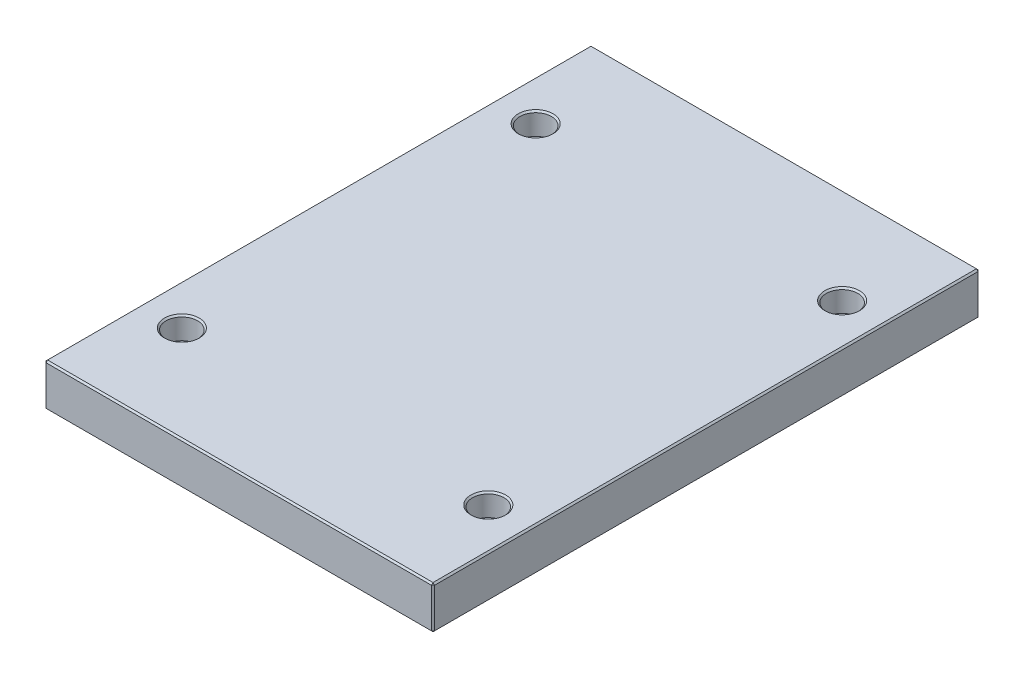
ISO-10303-21;
HEADER;
FILE_DESCRIPTION(('STEP AP214'),'2;1');
FILE_NAME('part.step','',(''),(''),'','','');
FILE_SCHEMA(('AUTOMOTIVE_DESIGN { 1 0 10303 214 1 1 1 1 }'));
ENDSEC;
DATA;
#1=APPLICATION_CONTEXT('core data for automotive mechanical design processes');
#2=APPLICATION_PROTOCOL_DEFINITION('international standard','automotive_design',2000,#1);
#3=PRODUCT_CONTEXT('',#1,'mechanical');
#4=PRODUCT('Part','Part','',(#3));
#5=PRODUCT_RELATED_PRODUCT_CATEGORY('part','',(#4));
#6=PRODUCT_DEFINITION_FORMATION('','',#4);
#7=PRODUCT_DEFINITION_CONTEXT('part definition',#1,'design');
#8=PRODUCT_DEFINITION('design','',#6,#7);
#9=PRODUCT_DEFINITION_SHAPE('','',#8);
#10=(LENGTH_UNIT() NAMED_UNIT(*) SI_UNIT(.MILLI.,.METRE.));
#11=(NAMED_UNIT(*) PLANE_ANGLE_UNIT() SI_UNIT($,.RADIAN.));
#12=(NAMED_UNIT(*) SI_UNIT($,.STERADIAN.) SOLID_ANGLE_UNIT());
#13=UNCERTAINTY_MEASURE_WITH_UNIT(LENGTH_MEASURE(1.E-05),#10,'distance_accuracy_value','');
#14=(GEOMETRIC_REPRESENTATION_CONTEXT(3) GLOBAL_UNCERTAINTY_ASSIGNED_CONTEXT((#13)) GLOBAL_UNIT_ASSIGNED_CONTEXT((#10,
#11,#12)) REPRESENTATION_CONTEXT('',''));
#15=CARTESIAN_POINT('',(0.,0.,0.));
#16=DIRECTION('',(0.,0.,1.));
#17=DIRECTION('',(1.,0.,0.));
#18=AXIS2_PLACEMENT_3D('',#15,#16,#17);
#19=CARTESIAN_POINT('',(-123.,27.,173.));
#20=DIRECTION('',(1.,0.,0.));
#21=DIRECTION('',(0.,0.,-1.));
#22=AXIS2_PLACEMENT_3D('',#19,#20,#21);
#23=PLANE('',#22);
#24=DIRECTION('',(0.,-1.,0.));
#25=VECTOR('',#24,1.);
#26=CARTESIAN_POINT('',(-123.,27.,-172.));
#27=LINE('',#26,#25);
#28=CARTESIAN_POINT('',(-123.,26.,-172.));
#29=VERTEX_POINT('',#28);
#30=CARTESIAN_POINT('',(-123.,1.,-172.));
#31=VERTEX_POINT('',#30);
#32=EDGE_CURVE('E115',#29,#31,#27,.T.);
#33=ORIENTED_EDGE('',*,*,#32,.T.);
#34=DIRECTION('',(0.,0.,1.));
#35=VECTOR('',#34,1.);
#36=CARTESIAN_POINT('',(-123.,1.,173.));
#37=LINE('',#36,#35);
#38=CARTESIAN_POINT('',(-123.,1.,172.));
#39=VERTEX_POINT('',#38);
#40=EDGE_CURVE('E111',#31,#39,#37,.T.);
#41=ORIENTED_EDGE('',*,*,#40,.T.);
#42=DIRECTION('',(0.,1.,0.));
#43=VECTOR('',#42,1.);
#44=CARTESIAN_POINT('',(-123.,27.,172.));
#45=LINE('',#44,#43);
#46=CARTESIAN_POINT('',(-123.,26.,172.));
#47=VERTEX_POINT('',#46);
#48=EDGE_CURVE('E104',#39,#47,#45,.T.);
#49=ORIENTED_EDGE('',*,*,#48,.T.);
#50=DIRECTION('',(0.,0.,-1.));
#51=VECTOR('',#50,1.);
#52=CARTESIAN_POINT('',(-123.,26.,-173.));
#53=LINE('',#52,#51);
#54=EDGE_CURVE('E108',#47,#29,#53,.T.);
#55=ORIENTED_EDGE('',*,*,#54,.T.);
#56=EDGE_LOOP('',(#33,#41,#49,#55));
#57=FACE_BOUND('',#56,.T.);
#58=ADVANCED_FACE('F16',(#57),#23,.F.);
#59=CARTESIAN_POINT('',(123.,27.,173.));
#60=DIRECTION('',(0.,0.,-1.));
#61=DIRECTION('',(-1.,0.,0.));
#62=AXIS2_PLACEMENT_3D('',#59,#60,#61);
#63=PLANE('',#62);
#64=DIRECTION('',(-1.,0.,0.));
#65=VECTOR('',#64,1.);
#66=CARTESIAN_POINT('',(-123.,26.,173.));
#67=LINE('',#66,#65);
#68=CARTESIAN_POINT('',(122.,26.,173.));
#69=VERTEX_POINT('',#68);
#70=CARTESIAN_POINT('',(-122.,26.,173.));
#71=VERTEX_POINT('',#70);
#72=EDGE_CURVE('E170',#69,#71,#67,.T.);
#73=ORIENTED_EDGE('',*,*,#72,.T.);
#74=DIRECTION('',(0.,-1.,0.));
#75=VECTOR('',#74,1.);
#76=CARTESIAN_POINT('',(-122.,27.,173.));
#77=LINE('',#76,#75);
#78=CARTESIAN_POINT('',(-122.,0.999999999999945,173.));
#79=VERTEX_POINT('',#78);
#80=EDGE_CURVE('E123',#71,#79,#77,.T.);
#81=ORIENTED_EDGE('',*,*,#80,.T.);
#82=DIRECTION('',(1.,0.,0.));
#83=VECTOR('',#82,1.);
#84=CARTESIAN_POINT('',(123.,0.999999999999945,173.));
#85=LINE('',#84,#83);
#86=CARTESIAN_POINT('',(122.,0.999999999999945,173.));
#87=VERTEX_POINT('',#86);
#88=EDGE_CURVE('E174',#79,#87,#85,.T.);
#89=ORIENTED_EDGE('',*,*,#88,.T.);
#90=DIRECTION('',(0.,1.,0.));
#91=VECTOR('',#90,1.);
#92=CARTESIAN_POINT('',(122.,27.,173.));
#93=LINE('',#92,#91);
#94=EDGE_CURVE('E172',#87,#69,#93,.T.);
#95=ORIENTED_EDGE('',*,*,#94,.T.);
#96=EDGE_LOOP('',(#73,#81,#89,#95));
#97=FACE_BOUND('',#96,.T.);
#98=ADVANCED_FACE('F317',(#97),#63,.F.);
#99=CARTESIAN_POINT('',(123.,27.,173.));
#100=DIRECTION('',(-1.,0.,0.));
#101=DIRECTION('',(0.,0.,1.));
#102=AXIS2_PLACEMENT_3D('',#99,#100,#101);
#103=PLANE('',#102);
#104=DIRECTION('',(0.,0.,-1.));
#105=VECTOR('',#104,1.);
#106=CARTESIAN_POINT('',(123.,0.999999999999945,173.));
#107=LINE('',#106,#105);
#108=CARTESIAN_POINT('',(123.,0.999999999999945,172.));
#109=VERTEX_POINT('',#108);
#110=CARTESIAN_POINT('',(123.,0.999999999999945,-172.));
#111=VERTEX_POINT('',#110);
#112=EDGE_CURVE('E165',#109,#111,#107,.T.);
#113=ORIENTED_EDGE('',*,*,#112,.T.);
#114=DIRECTION('',(0.,1.,0.));
#115=VECTOR('',#114,1.);
#116=CARTESIAN_POINT('',(123.,27.,-172.));
#117=LINE('',#116,#115);
#118=CARTESIAN_POINT('',(123.,26.,-172.));
#119=VERTEX_POINT('',#118);
#120=EDGE_CURVE('E167',#111,#119,#117,.T.);
#121=ORIENTED_EDGE('',*,*,#120,.T.);
#122=DIRECTION('',(0.,0.,1.));
#123=VECTOR('',#122,1.);
#124=CARTESIAN_POINT('',(123.,26.,173.));
#125=LINE('',#124,#123);
#126=CARTESIAN_POINT('',(123.,26.,172.));
#127=VERTEX_POINT('',#126);
#128=EDGE_CURVE('E161',#119,#127,#125,.T.);
#129=ORIENTED_EDGE('',*,*,#128,.T.);
#130=DIRECTION('',(0.,-1.,0.));
#131=VECTOR('',#130,1.);
#132=CARTESIAN_POINT('',(123.,27.,172.));
#133=LINE('',#132,#131);
#134=EDGE_CURVE('E163',#127,#109,#133,.T.);
#135=ORIENTED_EDGE('',*,*,#134,.T.);
#136=EDGE_LOOP('',(#113,#121,#129,#135));
#137=FACE_BOUND('',#136,.T.);
#138=ADVANCED_FACE('F323',(#137),#103,.F.);
#139=CARTESIAN_POINT('',(123.,27.,-173.));
#140=DIRECTION('',(0.,0.,1.));
#141=DIRECTION('',(1.,0.,0.));
#142=AXIS2_PLACEMENT_3D('',#139,#140,#141);
#143=PLANE('',#142);
#144=DIRECTION('',(0.,-1.,0.));
#145=VECTOR('',#144,1.);
#146=CARTESIAN_POINT('',(122.,27.,-173.));
#147=LINE('',#146,#145);
#148=CARTESIAN_POINT('',(122.,26.,-173.));
#149=VERTEX_POINT('',#148);
#150=CARTESIAN_POINT('',(122.,0.999999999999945,-173.));
#151=VERTEX_POINT('',#150);
#152=EDGE_CURVE('E154',#149,#151,#147,.T.);
#153=ORIENTED_EDGE('',*,*,#152,.T.);
#154=DIRECTION('',(-1.,0.,0.));
#155=VECTOR('',#154,1.);
#156=CARTESIAN_POINT('',(123.,0.999999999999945,-173.));
#157=LINE('',#156,#155);
#158=CARTESIAN_POINT('',(-122.,0.999999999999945,-173.));
#159=VERTEX_POINT('',#158);
#160=EDGE_CURVE('E159',#151,#159,#157,.T.);
#161=ORIENTED_EDGE('',*,*,#160,.T.);
#162=DIRECTION('',(0.,1.,0.));
#163=VECTOR('',#162,1.);
#164=CARTESIAN_POINT('',(-122.,27.,-173.));
#165=LINE('',#164,#163);
#166=CARTESIAN_POINT('',(-122.,26.,-173.));
#167=VERTEX_POINT('',#166);
#168=EDGE_CURVE('E156',#159,#167,#165,.T.);
#169=ORIENTED_EDGE('',*,*,#168,.T.);
#170=DIRECTION('',(1.,0.,0.));
#171=VECTOR('',#170,1.);
#172=CARTESIAN_POINT('',(123.,26.,-173.));
#173=LINE('',#172,#171);
#174=EDGE_CURVE('E152',#167,#149,#173,.T.);
#175=ORIENTED_EDGE('',*,*,#174,.T.);
#176=EDGE_LOOP('',(#153,#161,#169,#175));
#177=FACE_BOUND('',#176,.T.);
#178=ADVANCED_FACE('F465',(#177),#143,.F.);
#179=CARTESIAN_POINT('',(0.,27.,0.));
#180=DIRECTION('',(0.,1.,0.));
#181=DIRECTION('',(0.,0.,1.));
#182=AXIS2_PLACEMENT_3D('',#179,#180,#181);
#183=PLANE('',#182);
#184=CARTESIAN_POINT('',(-97.,27.,112.));
#185=DIRECTION('',(0.,1.,0.));
#186=DIRECTION('',(0.,0.,1.));
#187=AXIS2_PLACEMENT_3D('',#184,#185,#186);
#188=CIRCLE('',#187,11.);
#189=CARTESIAN_POINT('',(-97.,27.,123.));
#190=VERTEX_POINT('',#189);
#191=EDGE_CURVE('E290',#190,#190,#188,.F.);
#192=ORIENTED_EDGE('',*,*,#191,.T.);
#193=EDGE_LOOP('',(#192));
#194=FACE_BOUND('',#193,.T.);
#195=CARTESIAN_POINT('',(97.,27.,112.));
#196=DIRECTION('',(0.,1.,0.));
#197=DIRECTION('',(0.,0.,1.));
#198=AXIS2_PLACEMENT_3D('',#195,#196,#197);
#199=CIRCLE('',#198,11.);
#200=CARTESIAN_POINT('',(97.,27.,123.));
#201=VERTEX_POINT('',#200);
#202=EDGE_CURVE('E287',#201,#201,#199,.F.);
#203=ORIENTED_EDGE('',*,*,#202,.T.);
#204=EDGE_LOOP('',(#203));
#205=FACE_BOUND('',#204,.T.);
#206=CARTESIAN_POINT('',(97.,27.,-112.));
#207=DIRECTION('',(0.,1.,0.));
#208=DIRECTION('',(0.,0.,1.));
#209=AXIS2_PLACEMENT_3D('',#206,#207,#208);
#210=CIRCLE('',#209,11.);
#211=CARTESIAN_POINT('',(97.,27.,-101.));
#212=VERTEX_POINT('',#211);
#213=EDGE_CURVE('E284',#212,#212,#210,.F.);
#214=ORIENTED_EDGE('',*,*,#213,.T.);
#215=EDGE_LOOP('',(#214));
#216=FACE_BOUND('',#215,.T.);
#217=CARTESIAN_POINT('',(-97.,27.,-112.));
#218=DIRECTION('',(0.,1.,0.));
#219=DIRECTION('',(0.,0.,1.));
#220=AXIS2_PLACEMENT_3D('',#217,#218,#219);
#221=CIRCLE('',#220,11.);
#222=CARTESIAN_POINT('',(-97.,27.,-101.));
#223=VERTEX_POINT('',#222);
#224=EDGE_CURVE('E281',#223,#223,#221,.F.);
#225=ORIENTED_EDGE('',*,*,#224,.T.);
#226=EDGE_LOOP('',(#225));
#227=FACE_BOUND('',#226,.T.);
#228=DIRECTION('',(0.,0.,-1.));
#229=VECTOR('',#228,1.);
#230=CARTESIAN_POINT('',(122.,27.,-173.));
#231=LINE('',#230,#229);
#232=CARTESIAN_POINT('',(122.,27.,172.));
#233=VERTEX_POINT('',#232);
#234=CARTESIAN_POINT('',(122.,27.,-172.));
#235=VERTEX_POINT('',#234);
#236=EDGE_CURVE('E31',#233,#235,#231,.T.);
#237=ORIENTED_EDGE('',*,*,#236,.T.);
#238=DIRECTION('',(-1.,0.,0.));
#239=VECTOR('',#238,1.);
#240=CARTESIAN_POINT('',(-123.,27.,-172.));
#241=LINE('',#240,#239);
#242=CARTESIAN_POINT('',(-122.,27.,-172.));
#243=VERTEX_POINT('',#242);
#244=EDGE_CURVE('E190',#235,#243,#241,.T.);
#245=ORIENTED_EDGE('',*,*,#244,.T.);
#246=DIRECTION('',(0.,0.,1.));
#247=VECTOR('',#246,1.);
#248=CARTESIAN_POINT('',(-122.,27.,173.));
#249=LINE('',#248,#247);
#250=CARTESIAN_POINT('',(-122.,27.,172.));
#251=VERTEX_POINT('',#250);
#252=EDGE_CURVE('E186',#243,#251,#249,.T.);
#253=ORIENTED_EDGE('',*,*,#252,.T.);
#254=DIRECTION('',(1.,0.,0.));
#255=VECTOR('',#254,1.);
#256=CARTESIAN_POINT('',(123.,27.,172.));
#257=LINE('',#256,#255);
#258=EDGE_CURVE('E36',#251,#233,#257,.T.);
#259=ORIENTED_EDGE('',*,*,#258,.T.);
#260=EDGE_LOOP('',(#237,#245,#253,#259));
#261=FACE_BOUND('',#260,.T.);
#262=ADVANCED_FACE('F462',(#194,#205,#216,#227,#261),#183,.T.);
#263=CARTESIAN_POINT('',(0.,0.,0.));
#264=DIRECTION('',(0.,1.,0.));
#265=DIRECTION('',(0.,0.,1.));
#266=AXIS2_PLACEMENT_3D('',#263,#264,#265);
#267=PLANE('',#266);
#268=CARTESIAN_POINT('',(97.,0.,-112.));
#269=DIRECTION('',(0.,1.,0.));
#270=DIRECTION('',(0.,0.,1.));
#271=AXIS2_PLACEMENT_3D('',#268,#269,#270);
#272=CIRCLE('',#271,8.);
#273=CARTESIAN_POINT('',(97.,0.,-104.));
#274=VERTEX_POINT('',#273);
#275=EDGE_CURVE('E263',#274,#274,#272,.T.);
#276=ORIENTED_EDGE('',*,*,#275,.T.);
#277=EDGE_LOOP('',(#276));
#278=FACE_BOUND('',#277,.T.);
#279=CARTESIAN_POINT('',(97.,0.,112.));
#280=DIRECTION('',(0.,1.,0.));
#281=DIRECTION('',(0.,0.,1.));
#282=AXIS2_PLACEMENT_3D('',#279,#280,#281);
#283=CIRCLE('',#282,8.);
#284=CARTESIAN_POINT('',(97.,0.,120.));
#285=VERTEX_POINT('',#284);
#286=EDGE_CURVE('E260',#285,#285,#283,.T.);
#287=ORIENTED_EDGE('',*,*,#286,.T.);
#288=EDGE_LOOP('',(#287));
#289=FACE_BOUND('',#288,.T.);
#290=CARTESIAN_POINT('',(-97.,0.,112.));
#291=DIRECTION('',(0.,1.,0.));
#292=DIRECTION('',(0.,0.,1.));
#293=AXIS2_PLACEMENT_3D('',#290,#291,#292);
#294=CIRCLE('',#293,7.9999999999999);
#295=CARTESIAN_POINT('',(-97.,0.,120.));
#296=VERTEX_POINT('',#295);
#297=EDGE_CURVE('E257',#296,#296,#294,.T.);
#298=ORIENTED_EDGE('',*,*,#297,.T.);
#299=EDGE_LOOP('',(#298));
#300=FACE_BOUND('',#299,.T.);
#301=CARTESIAN_POINT('',(-97.,0.,-112.));
#302=DIRECTION('',(0.,1.,0.));
#303=DIRECTION('',(0.,0.,1.));
#304=AXIS2_PLACEMENT_3D('',#301,#302,#303);
#305=CIRCLE('',#304,8.);
#306=CARTESIAN_POINT('',(-97.,0.,-104.));
#307=VERTEX_POINT('',#306);
#308=EDGE_CURVE('E192',#307,#307,#305,.T.);
#309=ORIENTED_EDGE('',*,*,#308,.T.);
#310=EDGE_LOOP('',(#309));
#311=FACE_BOUND('',#310,.T.);
#312=DIRECTION('',(0.,0.,1.));
#313=VECTOR('',#312,1.);
#314=CARTESIAN_POINT('',(122.,0.,0.));
#315=LINE('',#314,#313);
#316=CARTESIAN_POINT('',(122.,0.,-172.));
#317=VERTEX_POINT('',#316);
#318=CARTESIAN_POINT('',(122.,0.,172.));
#319=VERTEX_POINT('',#318);
#320=EDGE_CURVE('E177',#317,#319,#315,.T.);
#321=ORIENTED_EDGE('',*,*,#320,.T.);
#322=DIRECTION('',(-1.,0.,0.));
#323=VECTOR('',#322,1.);
#324=CARTESIAN_POINT('',(0.,0.,172.));
#325=LINE('',#324,#323);
#326=CARTESIAN_POINT('',(-122.,0.,172.));
#327=VERTEX_POINT('',#326);
#328=EDGE_CURVE('E183',#319,#327,#325,.T.);
#329=ORIENTED_EDGE('',*,*,#328,.T.);
#330=DIRECTION('',(0.,0.,-1.));
#331=VECTOR('',#330,1.);
#332=CARTESIAN_POINT('',(-122.,0.,0.));
#333=LINE('',#332,#331);
#334=CARTESIAN_POINT('',(-122.,0.,-172.));
#335=VERTEX_POINT('',#334);
#336=EDGE_CURVE('E181',#327,#335,#333,.T.);
#337=ORIENTED_EDGE('',*,*,#336,.T.);
#338=DIRECTION('',(1.,0.,0.));
#339=VECTOR('',#338,1.);
#340=CARTESIAN_POINT('',(0.,0.,-172.));
#341=LINE('',#340,#339);
#342=EDGE_CURVE('E179',#335,#317,#341,.T.);
#343=ORIENTED_EDGE('',*,*,#342,.T.);
#344=EDGE_LOOP('',(#321,#329,#337,#343));
#345=FACE_BOUND('',#344,.T.);
#346=ADVANCED_FACE('F402',(#278,#289,#300,#311,#345),#267,.F.);
#347=CARTESIAN_POINT('',(123.,27.,172.));
#348=DIRECTION('',(-0.707106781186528,0.,-0.707106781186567));
#349=DIRECTION('',(0.,-1.,0.));
#350=AXIS2_PLACEMENT_3D('',#347,#348,#349);
#351=PLANE('',#350);
#352=DIRECTION('',(-0.707106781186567,0.,0.707106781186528));
#353=VECTOR('',#352,1.);
#354=CARTESIAN_POINT('',(122.,26.,173.));
#355=LINE('',#354,#353);
#356=EDGE_CURVE('E141',#69,#127,#355,.F.);
#357=ORIENTED_EDGE('',*,*,#356,.F.);
#358=ORIENTED_EDGE('',*,*,#94,.F.);
#359=DIRECTION('',(0.707106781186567,0.,-0.707106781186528));
#360=VECTOR('',#359,1.);
#361=CARTESIAN_POINT('',(122.,0.999999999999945,173.));
#362=LINE('',#361,#360);
#363=EDGE_CURVE('E144',#109,#87,#362,.F.);
#364=ORIENTED_EDGE('',*,*,#363,.F.);
#365=ORIENTED_EDGE('',*,*,#134,.F.);
#366=EDGE_LOOP('',(#357,#358,#364,#365));
#367=FACE_BOUND('',#366,.T.);
#368=ADVANCED_FACE('F398',(#367),#351,.F.);
#369=CARTESIAN_POINT('',(122.,26.,173.));
#370=DIRECTION('',(0.577350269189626,0.577350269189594,0.577350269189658));
#371=DIRECTION('',(0.707106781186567,0.,-0.707106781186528));
#372=AXIS2_PLACEMENT_3D('',#369,#370,#371);
#373=PLANE('',#372);
#374=DIRECTION('',(0.,-0.707106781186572,0.707106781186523));
#375=VECTOR('',#374,1.);
#376=CARTESIAN_POINT('',(122.,26.,173.));
#377=LINE('',#376,#375);
#378=EDGE_CURVE('E235',#69,#233,#377,.F.);
#379=ORIENTED_EDGE('',*,*,#378,.F.);
#380=ORIENTED_EDGE('',*,*,#356,.T.);
#381=DIRECTION('',(-0.707106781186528,0.707106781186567,0.));
#382=VECTOR('',#381,1.);
#383=CARTESIAN_POINT('',(122.5,26.5,172.));
#384=LINE('',#383,#382);
#385=EDGE_CURVE('E237',#233,#127,#384,.F.);
#386=ORIENTED_EDGE('',*,*,#385,.F.);
#387=EDGE_LOOP('',(#379,#380,#386));
#388=FACE_BOUND('',#387,.T.);
#389=ADVANCED_FACE('F394',(#388),#373,.T.);
#390=CARTESIAN_POINT('',(122.,0.999999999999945,173.));
#391=DIRECTION('',(0.577350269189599,-0.577350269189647,0.577350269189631));
#392=DIRECTION('',(0.,-0.707106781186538,-0.707106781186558));
#393=AXIS2_PLACEMENT_3D('',#390,#391,#392);
#394=PLANE('',#393);
#395=DIRECTION('',(-0.707106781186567,-0.707106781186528,0.));
#396=VECTOR('',#395,1.);
#397=CARTESIAN_POINT('',(122.5,0.499999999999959,172.));
#398=LINE('',#397,#396);
#399=EDGE_CURVE('E229',#109,#319,#398,.T.);
#400=ORIENTED_EDGE('',*,*,#399,.F.);
#401=ORIENTED_EDGE('',*,*,#363,.T.);
#402=DIRECTION('',(0.,0.707106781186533,0.707106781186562));
#403=VECTOR('',#402,1.);
#404=CARTESIAN_POINT('',(122.,0.999999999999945,173.));
#405=LINE('',#404,#403);
#406=EDGE_CURVE('E232',#319,#87,#405,.T.);
#407=ORIENTED_EDGE('',*,*,#406,.F.);
#408=EDGE_LOOP('',(#400,#401,#407));
#409=FACE_BOUND('',#408,.T.);
#410=ADVANCED_FACE('F390',(#409),#394,.T.);
#411=CARTESIAN_POINT('',(122.,27.,0.));
#412=DIRECTION('',(0.707106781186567,0.707106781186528,0.));
#413=DIRECTION('',(0.,0.,1.));
#414=AXIS2_PLACEMENT_3D('',#411,#412,#413);
#415=PLANE('',#414);
#416=ORIENTED_EDGE('',*,*,#385,.T.);
#417=ORIENTED_EDGE('',*,*,#128,.F.);
#418=DIRECTION('',(0.707106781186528,-0.707106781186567,0.));
#419=VECTOR('',#418,1.);
#420=CARTESIAN_POINT('',(123.,26.,-172.));
#421=LINE('',#420,#419);
#422=EDGE_CURVE('E224',#235,#119,#421,.T.);
#423=ORIENTED_EDGE('',*,*,#422,.F.);
#424=ORIENTED_EDGE('',*,*,#236,.F.);
#425=EDGE_LOOP('',(#416,#417,#423,#424));
#426=FACE_BOUND('',#425,.T.);
#427=ADVANCED_FACE('F386',(#426),#415,.T.);
#428=CARTESIAN_POINT('',(0.,27.,172.));
#429=DIRECTION('',(0.,0.707106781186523,0.707106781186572));
#430=DIRECTION('',(-1.,0.,0.));
#431=AXIS2_PLACEMENT_3D('',#428,#429,#430);
#432=PLANE('',#431);
#433=ORIENTED_EDGE('',*,*,#378,.T.);
#434=ORIENTED_EDGE('',*,*,#258,.F.);
#435=DIRECTION('',(0.,0.707106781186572,-0.707106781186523));
#436=VECTOR('',#435,1.);
#437=CARTESIAN_POINT('',(-122.,26.5,172.5));
#438=LINE('',#437,#436);
#439=EDGE_CURVE('E127',#71,#251,#438,.T.);
#440=ORIENTED_EDGE('',*,*,#439,.F.);
#441=ORIENTED_EDGE('',*,*,#72,.F.);
#442=EDGE_LOOP('',(#433,#434,#440,#441));
#443=FACE_BOUND('',#442,.T.);
#444=ADVANCED_FACE('F383',(#443),#432,.T.);
#445=CARTESIAN_POINT('',(-122.,27.,173.));
#446=DIRECTION('',(0.707106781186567,0.,-0.707106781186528));
#447=DIRECTION('',(0.,-1.,0.));
#448=AXIS2_PLACEMENT_3D('',#445,#446,#447);
#449=PLANE('',#448);
#450=DIRECTION('',(0.707106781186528,0.,0.707106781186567));
#451=VECTOR('',#450,1.);
#452=CARTESIAN_POINT('',(-122.,0.999999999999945,173.));
#453=LINE('',#452,#451);
#454=EDGE_CURVE('E128',#79,#39,#453,.F.);
#455=ORIENTED_EDGE('',*,*,#454,.F.);
#456=ORIENTED_EDGE('',*,*,#80,.F.);
#457=DIRECTION('',(-0.707106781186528,0.,-0.707106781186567));
#458=VECTOR('',#457,1.);
#459=CARTESIAN_POINT('',(-123.,26.,172.));
#460=LINE('',#459,#458);
#461=EDGE_CURVE('E119',#47,#71,#460,.F.);
#462=ORIENTED_EDGE('',*,*,#461,.F.);
#463=ORIENTED_EDGE('',*,*,#48,.F.);
#464=EDGE_LOOP('',(#455,#456,#462,#463));
#465=FACE_BOUND('',#464,.T.);
#466=ADVANCED_FACE('F121',(#465),#449,.F.);
#467=CARTESIAN_POINT('',(123.,0.999999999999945,173.));
#468=DIRECTION('',(0.,0.707106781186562,-0.707106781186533));
#469=DIRECTION('',(1.,0.,0.));
#470=AXIS2_PLACEMENT_3D('',#467,#468,#469);
#471=PLANE('',#470);
#472=ORIENTED_EDGE('',*,*,#406,.T.);
#473=ORIENTED_EDGE('',*,*,#88,.F.);
#474=DIRECTION('',(0.,-0.707106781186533,-0.707106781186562));
#475=VECTOR('',#474,1.);
#476=CARTESIAN_POINT('',(-122.,0.999999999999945,173.));
#477=LINE('',#476,#475);
#478=EDGE_CURVE('E220',#327,#79,#477,.F.);
#479=ORIENTED_EDGE('',*,*,#478,.F.);
#480=ORIENTED_EDGE('',*,*,#328,.F.);
#481=EDGE_LOOP('',(#472,#473,#479,#480));
#482=FACE_BOUND('',#481,.T.);
#483=ADVANCED_FACE('F376',(#482),#471,.F.);
#484=CARTESIAN_POINT('',(123.,0.999999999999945,173.));
#485=DIRECTION('',(-0.707106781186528,0.707106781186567,0.));
#486=DIRECTION('',(0.,0.,-1.));
#487=AXIS2_PLACEMENT_3D('',#484,#485,#486);
#488=PLANE('',#487);
#489=ORIENTED_EDGE('',*,*,#399,.T.);
#490=ORIENTED_EDGE('',*,*,#320,.F.);
#491=DIRECTION('',(0.707106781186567,0.707106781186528,0.));
#492=VECTOR('',#491,1.);
#493=CARTESIAN_POINT('',(122.5,0.499999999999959,-172.));
#494=LINE('',#493,#492);
#495=EDGE_CURVE('E217',#111,#317,#494,.F.);
#496=ORIENTED_EDGE('',*,*,#495,.F.);
#497=ORIENTED_EDGE('',*,*,#112,.F.);
#498=EDGE_LOOP('',(#489,#490,#496,#497));
#499=FACE_BOUND('',#498,.T.);
#500=ADVANCED_FACE('F372',(#499),#488,.F.);
#501=CARTESIAN_POINT('',(122.,27.,-173.));
#502=DIRECTION('',(-0.707106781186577,0.,0.707106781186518));
#503=DIRECTION('',(0.,-1.,0.));
#504=AXIS2_PLACEMENT_3D('',#501,#502,#503);
#505=PLANE('',#504);
#506=DIRECTION('',(0.707106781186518,0.,0.707106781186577));
#507=VECTOR('',#506,1.);
#508=CARTESIAN_POINT('',(123.,26.,-172.));
#509=LINE('',#508,#507);
#510=EDGE_CURVE('E226',#119,#149,#509,.F.);
#511=ORIENTED_EDGE('',*,*,#510,.F.);
#512=ORIENTED_EDGE('',*,*,#120,.F.);
#513=DIRECTION('',(-0.707106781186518,0.,-0.707106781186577));
#514=VECTOR('',#513,1.);
#515=CARTESIAN_POINT('',(122.,0.999999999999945,-173.));
#516=LINE('',#515,#514);
#517=EDGE_CURVE('E214',#151,#111,#516,.F.);
#518=ORIENTED_EDGE('',*,*,#517,.F.);
#519=ORIENTED_EDGE('',*,*,#152,.F.);
#520=EDGE_LOOP('',(#511,#512,#518,#519));
#521=FACE_BOUND('',#520,.T.);
#522=ADVANCED_FACE('F368',(#521),#505,.F.);
#523=CARTESIAN_POINT('',(123.,26.,-172.));
#524=DIRECTION('',(0.577350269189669,0.577350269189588,-0.57735026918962));
#525=DIRECTION('',(-0.707106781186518,0.,-0.707106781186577));
#526=AXIS2_PLACEMENT_3D('',#523,#524,#525);
#527=PLANE('',#526);
#528=ORIENTED_EDGE('',*,*,#422,.T.);
#529=ORIENTED_EDGE('',*,*,#510,.T.);
#530=DIRECTION('',(0.,0.707106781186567,0.707106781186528));
#531=VECTOR('',#530,1.);
#532=CARTESIAN_POINT('',(122.,26.5,-172.5));
#533=LINE('',#532,#531);
#534=EDGE_CURVE('E135',#235,#149,#533,.F.);
#535=ORIENTED_EDGE('',*,*,#534,.F.);
#536=EDGE_LOOP('',(#528,#529,#535));
#537=FACE_BOUND('',#536,.T.);
#538=ADVANCED_FACE('F365',(#537),#527,.T.);
#539=CARTESIAN_POINT('',(-123.,26.,172.));
#540=DIRECTION('',(-0.577350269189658,0.577350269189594,0.577350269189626));
#541=DIRECTION('',(0.707106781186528,0.,0.707106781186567));
#542=AXIS2_PLACEMENT_3D('',#539,#540,#541);
#543=PLANE('',#542);
#544=ORIENTED_EDGE('',*,*,#461,.T.);
#545=ORIENTED_EDGE('',*,*,#439,.T.);
#546=DIRECTION('',(-0.707106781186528,-0.707106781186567,0.));
#547=VECTOR('',#546,1.);
#548=CARTESIAN_POINT('',(-123.,26.,172.));
#549=LINE('',#548,#547);
#550=EDGE_CURVE('E131',#47,#251,#549,.F.);
#551=ORIENTED_EDGE('',*,*,#550,.F.);
#552=EDGE_LOOP('',(#544,#545,#551));
#553=FACE_BOUND('',#552,.T.);
#554=ADVANCED_FACE('F132',(#553),#543,.T.);
#555=CARTESIAN_POINT('',(-122.,0.999999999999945,173.));
#556=DIRECTION('',(-0.577350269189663,-0.577350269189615,0.577350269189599));
#557=DIRECTION('',(0.707106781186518,-0.707106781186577,0.));
#558=AXIS2_PLACEMENT_3D('',#555,#556,#557);
#559=PLANE('',#558);
#560=ORIENTED_EDGE('',*,*,#478,.T.);
#561=ORIENTED_EDGE('',*,*,#454,.T.);
#562=DIRECTION('',(-0.707106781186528,0.707106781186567,0.));
#563=VECTOR('',#562,1.);
#564=CARTESIAN_POINT('',(-122.5,0.499999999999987,172.));
#565=LINE('',#564,#563);
#566=EDGE_CURVE('E136',#327,#39,#565,.T.);
#567=ORIENTED_EDGE('',*,*,#566,.F.);
#568=EDGE_LOOP('',(#560,#561,#567));
#569=FACE_BOUND('',#568,.T.);
#570=ADVANCED_FACE('F358',(#569),#559,.T.);
#571=CARTESIAN_POINT('',(122.,0.999999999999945,-173.));
#572=DIRECTION('',(0.577350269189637,-0.577350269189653,-0.577350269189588));
#573=DIRECTION('',(0.707106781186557,0.707106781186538,0.));
#574=AXIS2_PLACEMENT_3D('',#571,#572,#573);
#575=PLANE('',#574);
#576=ORIENTED_EDGE('',*,*,#517,.T.);
#577=ORIENTED_EDGE('',*,*,#495,.T.);
#578=DIRECTION('',(0.,-0.707106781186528,0.707106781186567));
#579=VECTOR('',#578,1.);
#580=CARTESIAN_POINT('',(122.,0.999999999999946,-173.));
#581=LINE('',#580,#579);
#582=EDGE_CURVE('E207',#151,#317,#581,.T.);
#583=ORIENTED_EDGE('',*,*,#582,.F.);
#584=EDGE_LOOP('',(#576,#577,#583));
#585=FACE_BOUND('',#584,.T.);
#586=ADVANCED_FACE('F354',(#585),#575,.T.);
#587=CARTESIAN_POINT('',(0.,27.,-172.));
#588=DIRECTION('',(0.,0.707106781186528,-0.707106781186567));
#589=DIRECTION('',(1.,0.,0.));
#590=AXIS2_PLACEMENT_3D('',#587,#588,#589);
#591=PLANE('',#590);
#592=ORIENTED_EDGE('',*,*,#534,.T.);
#593=ORIENTED_EDGE('',*,*,#174,.F.);
#594=DIRECTION('',(0.,-0.707106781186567,-0.707106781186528));
#595=VECTOR('',#594,1.);
#596=CARTESIAN_POINT('',(-122.,26.,-173.));
#597=LINE('',#596,#595);
#598=EDGE_CURVE('E204',#243,#167,#597,.T.);
#599=ORIENTED_EDGE('',*,*,#598,.F.);
#600=ORIENTED_EDGE('',*,*,#244,.F.);
#601=EDGE_LOOP('',(#592,#593,#599,#600));
#602=FACE_BOUND('',#601,.T.);
#603=ADVANCED_FACE('F351',(#602),#591,.T.);
#604=CARTESIAN_POINT('',(-122.,27.,0.));
#605=DIRECTION('',(-0.707106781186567,0.707106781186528,0.));
#606=DIRECTION('',(0.,0.,-1.));
#607=AXIS2_PLACEMENT_3D('',#604,#605,#606);
#608=PLANE('',#607);
#609=ORIENTED_EDGE('',*,*,#550,.T.);
#610=ORIENTED_EDGE('',*,*,#252,.F.);
#611=DIRECTION('',(0.707106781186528,0.707106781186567,0.));
#612=VECTOR('',#611,1.);
#613=CARTESIAN_POINT('',(-122.5,26.5,-172.));
#614=LINE('',#613,#612);
#615=EDGE_CURVE('E139',#29,#243,#614,.T.);
#616=ORIENTED_EDGE('',*,*,#615,.F.);
#617=ORIENTED_EDGE('',*,*,#54,.F.);
#618=EDGE_LOOP('',(#609,#610,#616,#617));
#619=FACE_BOUND('',#618,.T.);
#620=ADVANCED_FACE('F138',(#619),#608,.T.);
#621=CARTESIAN_POINT('',(-123.,1.,173.));
#622=DIRECTION('',(0.707106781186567,0.707106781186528,0.));
#623=DIRECTION('',(0.,0.,1.));
#624=AXIS2_PLACEMENT_3D('',#621,#622,#623);
#625=PLANE('',#624);
#626=ORIENTED_EDGE('',*,*,#566,.T.);
#627=ORIENTED_EDGE('',*,*,#40,.F.);
#628=DIRECTION('',(0.707106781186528,-0.707106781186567,0.));
#629=VECTOR('',#628,1.);
#630=CARTESIAN_POINT('',(-123.,1.,-172.));
#631=LINE('',#630,#629);
#632=EDGE_CURVE('E200',#335,#31,#631,.F.);
#633=ORIENTED_EDGE('',*,*,#632,.F.);
#634=ORIENTED_EDGE('',*,*,#336,.F.);
#635=EDGE_LOOP('',(#626,#627,#633,#634));
#636=FACE_BOUND('',#635,.T.);
#637=ADVANCED_FACE('F344',(#636),#625,.F.);
#638=CARTESIAN_POINT('',(123.,0.999999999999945,-173.));
#639=DIRECTION('',(0.,0.707106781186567,0.707106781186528));
#640=DIRECTION('',(-1.,0.,0.));
#641=AXIS2_PLACEMENT_3D('',#638,#639,#640);
#642=PLANE('',#641);
#643=ORIENTED_EDGE('',*,*,#582,.T.);
#644=ORIENTED_EDGE('',*,*,#342,.F.);
#645=DIRECTION('',(0.,0.707106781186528,-0.707106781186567));
#646=VECTOR('',#645,1.);
#647=CARTESIAN_POINT('',(-122.,0.499999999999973,-172.5));
#648=LINE('',#647,#646);
#649=EDGE_CURVE('E197',#159,#335,#648,.F.);
#650=ORIENTED_EDGE('',*,*,#649,.F.);
#651=ORIENTED_EDGE('',*,*,#160,.F.);
#652=EDGE_LOOP('',(#643,#644,#650,#651));
#653=FACE_BOUND('',#652,.T.);
#654=ADVANCED_FACE('F340',(#653),#642,.F.);
#655=CARTESIAN_POINT('',(-122.,26.,-173.));
#656=DIRECTION('',(-0.577350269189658,0.577350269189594,-0.577350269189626));
#657=DIRECTION('',(-0.707106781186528,0.,0.707106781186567));
#658=AXIS2_PLACEMENT_3D('',#655,#656,#657);
#659=PLANE('',#658);
#660=ORIENTED_EDGE('',*,*,#615,.T.);
#661=ORIENTED_EDGE('',*,*,#598,.T.);
#662=DIRECTION('',(0.707106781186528,0.,-0.707106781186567));
#663=VECTOR('',#662,1.);
#664=CARTESIAN_POINT('',(-122.,26.,-173.));
#665=LINE('',#664,#663);
#666=EDGE_CURVE('E195',#29,#167,#665,.T.);
#667=ORIENTED_EDGE('',*,*,#666,.F.);
#668=EDGE_LOOP('',(#660,#661,#667));
#669=FACE_BOUND('',#668,.T.);
#670=ADVANCED_FACE('F336',(#669),#659,.T.);
#671=CARTESIAN_POINT('',(-123.,1.,-172.));
#672=DIRECTION('',(-0.577350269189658,-0.577350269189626,-0.577350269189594));
#673=DIRECTION('',(0.707106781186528,-0.707106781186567,0.));
#674=AXIS2_PLACEMENT_3D('',#671,#672,#673);
#675=PLANE('',#674);
#676=ORIENTED_EDGE('',*,*,#649,.T.);
#677=ORIENTED_EDGE('',*,*,#632,.T.);
#678=DIRECTION('',(-0.707106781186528,0.,0.707106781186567));
#679=VECTOR('',#678,1.);
#680=CARTESIAN_POINT('',(-123.,1.,-172.));
#681=LINE('',#680,#679);
#682=EDGE_CURVE('E193',#159,#31,#681,.T.);
#683=ORIENTED_EDGE('',*,*,#682,.F.);
#684=EDGE_LOOP('',(#676,#677,#683));
#685=FACE_BOUND('',#684,.T.);
#686=ADVANCED_FACE('F332',(#685),#675,.T.);
#687=CARTESIAN_POINT('',(-123.,27.,-172.));
#688=DIRECTION('',(0.707106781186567,0.,0.707106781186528));
#689=DIRECTION('',(0.,-1.,0.));
#690=AXIS2_PLACEMENT_3D('',#687,#688,#689);
#691=PLANE('',#690);
#692=ORIENTED_EDGE('',*,*,#666,.T.);
#693=ORIENTED_EDGE('',*,*,#168,.F.);
#694=ORIENTED_EDGE('',*,*,#682,.T.);
#695=ORIENTED_EDGE('',*,*,#32,.F.);
#696=EDGE_LOOP('',(#692,#693,#694,#695));
#697=FACE_BOUND('',#696,.T.);
#698=ADVANCED_FACE('F328',(#697),#691,.F.);
#699=CARTESIAN_POINT('',(-97.,13.,-112.));
#700=DIRECTION('',(0.,1.,0.));
#701=DIRECTION('',(0.,0.,1.));
#702=AXIS2_PLACEMENT_3D('',#699,#700,#701);
#703=CYLINDRICAL_SURFACE('',#702,10.);
#704=CARTESIAN_POINT('',(-97.,26.,-112.));
#705=DIRECTION('',(0.,1.,0.));
#706=DIRECTION('',(0.,0.,1.));
#707=AXIS2_PLACEMENT_3D('',#704,#705,#706);
#708=CIRCLE('',#707,10.);
#709=CARTESIAN_POINT('',(-97.,26.,-102.));
#710=VERTEX_POINT('',#709);
#711=EDGE_CURVE('E10',#710,#710,#708,.T.);
#712=ORIENTED_EDGE('',*,*,#711,.T.);
#713=EDGE_LOOP('',(#712));
#714=FACE_BOUND('',#713,.T.);
#715=CARTESIAN_POINT('',(-97.,13.,-112.));
#716=DIRECTION('',(0.,1.,0.));
#717=DIRECTION('',(0.,0.,1.));
#718=AXIS2_PLACEMENT_3D('',#715,#716,#717);
#719=CIRCLE('',#718,10.);
#720=CARTESIAN_POINT('',(-97.,13.,-102.));
#721=VERTEX_POINT('',#720);
#722=EDGE_CURVE('E147',#721,#721,#719,.T.);
#723=ORIENTED_EDGE('',*,*,#722,.F.);
#724=EDGE_LOOP('',(#723));
#725=FACE_BOUND('',#724,.T.);
#726=ADVANCED_FACE('F331',(#714,#725),#703,.F.);
#727=CARTESIAN_POINT('',(-97.,13.,-112.));
#728=DIRECTION('',(0.,1.,0.));
#729=DIRECTION('',(0.,0.,1.));
#730=AXIS2_PLACEMENT_3D('',#727,#728,#729);
#731=PLANE('',#730);
#732=CARTESIAN_POINT('',(-97.,13.,-112.));
#733=DIRECTION('',(0.,1.,0.));
#734=DIRECTION('',(0.,0.,1.));
#735=AXIS2_PLACEMENT_3D('',#732,#733,#734);
#736=CIRCLE('',#735,7.);
#737=CARTESIAN_POINT('',(-97.,13.,-105.));
#738=VERTEX_POINT('',#737);
#739=EDGE_CURVE('E251',#738,#738,#736,.T.);
#740=ORIENTED_EDGE('',*,*,#739,.F.);
#741=EDGE_LOOP('',(#740));
#742=FACE_BOUND('',#741,.T.);
#743=ORIENTED_EDGE('',*,*,#722,.T.);
#744=EDGE_LOOP('',(#743));
#745=FACE_BOUND('',#744,.T.);
#746=ADVANCED_FACE('F450',(#742,#745),#731,.T.);
#747=CARTESIAN_POINT('',(97.,13.,-112.));
#748=DIRECTION('',(0.,1.,0.));
#749=DIRECTION('',(0.,0.,1.));
#750=AXIS2_PLACEMENT_3D('',#747,#748,#749);
#751=CYLINDRICAL_SURFACE('',#750,10.);
#752=CARTESIAN_POINT('',(97.,26.,-112.));
#753=DIRECTION('',(0.,1.,0.));
#754=DIRECTION('',(0.,0.,1.));
#755=AXIS2_PLACEMENT_3D('',#752,#753,#754);
#756=CIRCLE('',#755,10.);
#757=CARTESIAN_POINT('',(97.,26.,-102.));
#758=VERTEX_POINT('',#757);
#759=EDGE_CURVE('E24',#758,#758,#756,.T.);
#760=ORIENTED_EDGE('',*,*,#759,.T.);
#761=EDGE_LOOP('',(#760));
#762=FACE_BOUND('',#761,.T.);
#763=CARTESIAN_POINT('',(97.,13.,-112.));
#764=DIRECTION('',(0.,1.,0.));
#765=DIRECTION('',(0.,0.,1.));
#766=AXIS2_PLACEMENT_3D('',#763,#764,#765);
#767=CIRCLE('',#766,10.);
#768=CARTESIAN_POINT('',(97.,13.,-102.));
#769=VERTEX_POINT('',#768);
#770=EDGE_CURVE('E441',#769,#769,#767,.T.);
#771=ORIENTED_EDGE('',*,*,#770,.F.);
#772=EDGE_LOOP('',(#771));
#773=FACE_BOUND('',#772,.T.);
#774=ADVANCED_FACE('F298',(#762,#773),#751,.F.);
#775=CARTESIAN_POINT('',(97.,13.,-112.));
#776=DIRECTION('',(0.,1.,0.));
#777=DIRECTION('',(0.,0.,1.));
#778=AXIS2_PLACEMENT_3D('',#775,#776,#777);
#779=PLANE('',#778);
#780=CARTESIAN_POINT('',(97.,13.,-112.));
#781=DIRECTION('',(0.,1.,0.));
#782=DIRECTION('',(0.,0.,1.));
#783=AXIS2_PLACEMENT_3D('',#780,#781,#782);
#784=CIRCLE('',#783,7.);
#785=CARTESIAN_POINT('',(97.,13.,-105.));
#786=VERTEX_POINT('',#785);
#787=EDGE_CURVE('E248',#786,#786,#784,.T.);
#788=ORIENTED_EDGE('',*,*,#787,.F.);
#789=EDGE_LOOP('',(#788));
#790=FACE_BOUND('',#789,.T.);
#791=ORIENTED_EDGE('',*,*,#770,.T.);
#792=EDGE_LOOP('',(#791));
#793=FACE_BOUND('',#792,.T.);
#794=ADVANCED_FACE('F738',(#790,#793),#779,.T.);
#795=CARTESIAN_POINT('',(97.,13.,112.));
#796=DIRECTION('',(0.,1.,0.));
#797=DIRECTION('',(0.,0.,1.));
#798=AXIS2_PLACEMENT_3D('',#795,#796,#797);
#799=CYLINDRICAL_SURFACE('',#798,10.);
#800=CARTESIAN_POINT('',(97.,26.,112.));
#801=DIRECTION('',(0.,1.,0.));
#802=DIRECTION('',(0.,0.,1.));
#803=AXIS2_PLACEMENT_3D('',#800,#801,#802);
#804=CIRCLE('',#803,10.);
#805=CARTESIAN_POINT('',(97.,26.,122.));
#806=VERTEX_POINT('',#805);
#807=EDGE_CURVE('E293',#806,#806,#804,.T.);
#808=ORIENTED_EDGE('',*,*,#807,.T.);
#809=EDGE_LOOP('',(#808));
#810=FACE_BOUND('',#809,.T.);
#811=CARTESIAN_POINT('',(97.,13.,112.));
#812=DIRECTION('',(0.,1.,0.));
#813=DIRECTION('',(0.,0.,1.));
#814=AXIS2_PLACEMENT_3D('',#811,#812,#813);
#815=CIRCLE('',#814,10.);
#816=CARTESIAN_POINT('',(97.,13.,122.));
#817=VERTEX_POINT('',#816);
#818=EDGE_CURVE('E439',#817,#817,#815,.T.);
#819=ORIENTED_EDGE('',*,*,#818,.F.);
#820=EDGE_LOOP('',(#819));
#821=FACE_BOUND('',#820,.T.);
#822=ADVANCED_FACE('F730',(#810,#821),#799,.F.);
#823=CARTESIAN_POINT('',(97.,13.,112.));
#824=DIRECTION('',(0.,1.,0.));
#825=DIRECTION('',(0.,0.,1.));
#826=AXIS2_PLACEMENT_3D('',#823,#824,#825);
#827=PLANE('',#826);
#828=CARTESIAN_POINT('',(97.,13.,112.));
#829=DIRECTION('',(0.,1.,0.));
#830=DIRECTION('',(0.,0.,1.));
#831=AXIS2_PLACEMENT_3D('',#828,#829,#830);
#832=CIRCLE('',#831,7.);
#833=CARTESIAN_POINT('',(97.,13.,119.));
#834=VERTEX_POINT('',#833);
#835=EDGE_CURVE('E245',#834,#834,#832,.T.);
#836=ORIENTED_EDGE('',*,*,#835,.F.);
#837=EDGE_LOOP('',(#836));
#838=FACE_BOUND('',#837,.T.);
#839=ORIENTED_EDGE('',*,*,#818,.T.);
#840=EDGE_LOOP('',(#839));
#841=FACE_BOUND('',#840,.T.);
#842=ADVANCED_FACE('F434',(#838,#841),#827,.T.);
#843=CARTESIAN_POINT('',(-97.,13.,112.));
#844=DIRECTION('',(0.,1.,0.));
#845=DIRECTION('',(0.,0.,1.));
#846=AXIS2_PLACEMENT_3D('',#843,#844,#845);
#847=CYLINDRICAL_SURFACE('',#846,10.);
#848=CARTESIAN_POINT('',(-97.,26.,112.));
#849=DIRECTION('',(0.,1.,0.));
#850=DIRECTION('',(0.,0.,1.));
#851=AXIS2_PLACEMENT_3D('',#848,#849,#850);
#852=CIRCLE('',#851,10.);
#853=CARTESIAN_POINT('',(-97.,26.,122.));
#854=VERTEX_POINT('',#853);
#855=EDGE_CURVE('E278',#854,#854,#852,.T.);
#856=ORIENTED_EDGE('',*,*,#855,.T.);
#857=EDGE_LOOP('',(#856));
#858=FACE_BOUND('',#857,.T.);
#859=CARTESIAN_POINT('',(-97.,13.,112.));
#860=DIRECTION('',(0.,1.,0.));
#861=DIRECTION('',(0.,0.,1.));
#862=AXIS2_PLACEMENT_3D('',#859,#860,#861);
#863=CIRCLE('',#862,10.);
#864=CARTESIAN_POINT('',(-97.,13.,122.));
#865=VERTEX_POINT('',#864);
#866=EDGE_CURVE('E254',#865,#865,#863,.T.);
#867=ORIENTED_EDGE('',*,*,#866,.F.);
#868=EDGE_LOOP('',(#867));
#869=FACE_BOUND('',#868,.T.);
#870=ADVANCED_FACE('F430',(#858,#869),#847,.F.);
#871=CARTESIAN_POINT('',(-97.,13.,112.));
#872=DIRECTION('',(0.,1.,0.));
#873=DIRECTION('',(0.,0.,1.));
#874=AXIS2_PLACEMENT_3D('',#871,#872,#873);
#875=PLANE('',#874);
#876=CARTESIAN_POINT('',(-97.,13.,112.));
#877=DIRECTION('',(0.,1.,0.));
#878=DIRECTION('',(0.,0.,1.));
#879=AXIS2_PLACEMENT_3D('',#876,#877,#878);
#880=CIRCLE('',#879,7.);
#881=CARTESIAN_POINT('',(-97.,13.,119.));
#882=VERTEX_POINT('',#881);
#883=EDGE_CURVE('E242',#882,#882,#880,.T.);
#884=ORIENTED_EDGE('',*,*,#883,.F.);
#885=EDGE_LOOP('',(#884));
#886=FACE_BOUND('',#885,.T.);
#887=ORIENTED_EDGE('',*,*,#866,.T.);
#888=EDGE_LOOP('',(#887));
#889=FACE_BOUND('',#888,.T.);
#890=ADVANCED_FACE('F433',(#886,#889),#875,.T.);
#891=CARTESIAN_POINT('',(-97.,0.,112.));
#892=DIRECTION('',(0.,1.,0.));
#893=DIRECTION('',(0.,0.,1.));
#894=AXIS2_PLACEMENT_3D('',#891,#892,#893);
#895=CYLINDRICAL_SURFACE('',#894,7.);
#896=CARTESIAN_POINT('',(-97.,0.999999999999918,112.));
#897=DIRECTION('',(0.,1.,0.));
#898=DIRECTION('',(0.,0.,1.));
#899=AXIS2_PLACEMENT_3D('',#896,#897,#898);
#900=CIRCLE('',#899,7.);
#901=CARTESIAN_POINT('',(-97.,0.999999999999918,119.));
#902=VERTEX_POINT('',#901);
#903=EDGE_CURVE('E272',#902,#902,#900,.F.);
#904=ORIENTED_EDGE('',*,*,#903,.T.);
#905=EDGE_LOOP('',(#904));
#906=FACE_BOUND('',#905,.T.);
#907=ORIENTED_EDGE('',*,*,#883,.T.);
#908=EDGE_LOOP('',(#907));
#909=FACE_BOUND('',#908,.T.);
#910=ADVANCED_FACE('F705',(#906,#909),#895,.F.);
#911=CARTESIAN_POINT('',(97.,0.,112.));
#912=DIRECTION('',(0.,1.,0.));
#913=DIRECTION('',(0.,0.,1.));
#914=AXIS2_PLACEMENT_3D('',#911,#912,#913);
#915=CYLINDRICAL_SURFACE('',#914,7.);
#916=CARTESIAN_POINT('',(97.,0.999999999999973,112.));
#917=DIRECTION('',(0.,1.,0.));
#918=DIRECTION('',(0.,0.,1.));
#919=AXIS2_PLACEMENT_3D('',#916,#917,#918);
#920=CIRCLE('',#919,7.);
#921=CARTESIAN_POINT('',(97.,0.999999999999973,119.));
#922=VERTEX_POINT('',#921);
#923=EDGE_CURVE('E269',#922,#922,#920,.F.);
#924=ORIENTED_EDGE('',*,*,#923,.T.);
#925=EDGE_LOOP('',(#924));
#926=FACE_BOUND('',#925,.T.);
#927=ORIENTED_EDGE('',*,*,#835,.T.);
#928=EDGE_LOOP('',(#927));
#929=FACE_BOUND('',#928,.T.);
#930=ADVANCED_FACE('F697',(#926,#929),#915,.F.);
#931=CARTESIAN_POINT('',(97.,0.,-112.));
#932=DIRECTION('',(0.,1.,0.));
#933=DIRECTION('',(0.,0.,1.));
#934=AXIS2_PLACEMENT_3D('',#931,#932,#933);
#935=CYLINDRICAL_SURFACE('',#934,7.);
#936=CARTESIAN_POINT('',(97.,0.999999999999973,-112.));
#937=DIRECTION('',(0.,1.,0.));
#938=DIRECTION('',(0.,0.,1.));
#939=AXIS2_PLACEMENT_3D('',#936,#937,#938);
#940=CIRCLE('',#939,7.);
#941=CARTESIAN_POINT('',(97.,0.999999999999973,-105.));
#942=VERTEX_POINT('',#941);
#943=EDGE_CURVE('E266',#942,#942,#940,.F.);
#944=ORIENTED_EDGE('',*,*,#943,.T.);
#945=EDGE_LOOP('',(#944));
#946=FACE_BOUND('',#945,.T.);
#947=ORIENTED_EDGE('',*,*,#787,.T.);
#948=EDGE_LOOP('',(#947));
#949=FACE_BOUND('',#948,.T.);
#950=ADVANCED_FACE('F688',(#946,#949),#935,.F.);
#951=CARTESIAN_POINT('',(-97.,0.,-112.));
#952=DIRECTION('',(0.,1.,0.));
#953=DIRECTION('',(0.,0.,1.));
#954=AXIS2_PLACEMENT_3D('',#951,#952,#953);
#955=CYLINDRICAL_SURFACE('',#954,7.);
#956=CARTESIAN_POINT('',(-97.,0.999999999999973,-112.));
#957=DIRECTION('',(0.,1.,0.));
#958=DIRECTION('',(0.,0.,1.));
#959=AXIS2_PLACEMENT_3D('',#956,#957,#958);
#960=CIRCLE('',#959,7.);
#961=CARTESIAN_POINT('',(-97.,0.999999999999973,-105.));
#962=VERTEX_POINT('',#961);
#963=EDGE_CURVE('E275',#962,#962,#960,.F.);
#964=ORIENTED_EDGE('',*,*,#963,.T.);
#965=EDGE_LOOP('',(#964));
#966=FACE_BOUND('',#965,.T.);
#967=ORIENTED_EDGE('',*,*,#739,.T.);
#968=EDGE_LOOP('',(#967));
#969=FACE_BOUND('',#968,.T.);
#970=ADVANCED_FACE('F408',(#966,#969),#955,.F.);
#971=CARTESIAN_POINT('',(97.,0.,-112.));
#972=DIRECTION('',(0.,-1.,0.));
#973=DIRECTION('',(0.,0.,-1.));
#974=AXIS2_PLACEMENT_3D('',#971,#972,#973);
#975=CONICAL_SURFACE('',#974,8.,0.785398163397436);
#976=ORIENTED_EDGE('',*,*,#943,.F.);
#977=EDGE_LOOP('',(#976));
#978=FACE_BOUND('',#977,.T.);
#979=ORIENTED_EDGE('',*,*,#275,.F.);
#980=EDGE_LOOP('',(#979));
#981=FACE_BOUND('',#980,.T.);
#982=ADVANCED_FACE('F404',(#978,#981),#975,.F.);
#983=CARTESIAN_POINT('',(97.,0.,112.));
#984=DIRECTION('',(0.,-1.,0.));
#985=DIRECTION('',(0.,0.,-1.));
#986=AXIS2_PLACEMENT_3D('',#983,#984,#985);
#987=CONICAL_SURFACE('',#986,8.,0.785398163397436);
#988=ORIENTED_EDGE('',*,*,#923,.F.);
#989=EDGE_LOOP('',(#988));
#990=FACE_BOUND('',#989,.T.);
#991=ORIENTED_EDGE('',*,*,#286,.F.);
#992=EDGE_LOOP('',(#991));
#993=FACE_BOUND('',#992,.T.);
#994=ADVANCED_FACE('F407',(#990,#993),#987,.F.);
#995=CARTESIAN_POINT('',(-97.,0.,112.));
#996=DIRECTION('',(0.,-1.,0.));
#997=DIRECTION('',(0.,0.,-1.));
#998=AXIS2_PLACEMENT_3D('',#995,#996,#997);
#999=CONICAL_SURFACE('',#998,7.9999999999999,0.785398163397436);
#1000=ORIENTED_EDGE('',*,*,#903,.F.);
#1001=EDGE_LOOP('',(#1000));
#1002=FACE_BOUND('',#1001,.T.);
#1003=ORIENTED_EDGE('',*,*,#297,.F.);
#1004=EDGE_LOOP('',(#1003));
#1005=FACE_BOUND('',#1004,.T.);
#1006=ADVANCED_FACE('F412',(#1002,#1005),#999,.F.);
#1007=CARTESIAN_POINT('',(-97.,0.,-112.));
#1008=DIRECTION('',(0.,-1.,0.));
#1009=DIRECTION('',(0.,0.,-1.));
#1010=AXIS2_PLACEMENT_3D('',#1007,#1008,#1009);
#1011=CONICAL_SURFACE('',#1010,8.,0.785398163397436);
#1012=ORIENTED_EDGE('',*,*,#963,.F.);
#1013=EDGE_LOOP('',(#1012));
#1014=FACE_BOUND('',#1013,.T.);
#1015=ORIENTED_EDGE('',*,*,#308,.F.);
#1016=EDGE_LOOP('',(#1015));
#1017=FACE_BOUND('',#1016,.T.);
#1018=ADVANCED_FACE('F416',(#1014,#1017),#1011,.F.);
#1019=CARTESIAN_POINT('',(-97.,26.,112.));
#1020=DIRECTION('',(0.,1.,0.));
#1021=DIRECTION('',(0.,0.,1.));
#1022=AXIS2_PLACEMENT_3D('',#1019,#1020,#1021);
#1023=CONICAL_SURFACE('',#1022,10.,0.78539816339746);
#1024=ORIENTED_EDGE('',*,*,#191,.F.);
#1025=EDGE_LOOP('',(#1024));
#1026=FACE_BOUND('',#1025,.T.);
#1027=ORIENTED_EDGE('',*,*,#855,.F.);
#1028=EDGE_LOOP('',(#1027));
#1029=FACE_BOUND('',#1028,.T.);
#1030=ADVANCED_FACE('F312',(#1026,#1029),#1023,.F.);
#1031=CARTESIAN_POINT('',(97.,26.,112.));
#1032=DIRECTION('',(0.,1.,0.));
#1033=DIRECTION('',(0.,0.,1.));
#1034=AXIS2_PLACEMENT_3D('',#1031,#1032,#1033);
#1035=CONICAL_SURFACE('',#1034,10.,0.785398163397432);
#1036=ORIENTED_EDGE('',*,*,#202,.F.);
#1037=EDGE_LOOP('',(#1036));
#1038=FACE_BOUND('',#1037,.T.);
#1039=ORIENTED_EDGE('',*,*,#807,.F.);
#1040=EDGE_LOOP('',(#1039));
#1041=FACE_BOUND('',#1040,.T.);
#1042=ADVANCED_FACE('F303',(#1038,#1041),#1035,.F.);
#1043=CARTESIAN_POINT('',(97.,26.,-112.));
#1044=DIRECTION('',(0.,1.,0.));
#1045=DIRECTION('',(0.,0.,1.));
#1046=AXIS2_PLACEMENT_3D('',#1043,#1044,#1045);
#1047=CONICAL_SURFACE('',#1046,10.,0.78539816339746);
#1048=ORIENTED_EDGE('',*,*,#213,.F.);
#1049=EDGE_LOOP('',(#1048));
#1050=FACE_BOUND('',#1049,.T.);
#1051=ORIENTED_EDGE('',*,*,#759,.F.);
#1052=EDGE_LOOP('',(#1051));
#1053=FACE_BOUND('',#1052,.T.);
#1054=ADVANCED_FACE('F301',(#1050,#1053),#1047,.F.);
#1055=CARTESIAN_POINT('',(-97.,26.,-112.));
#1056=DIRECTION('',(0.,1.,0.));
#1057=DIRECTION('',(0.,0.,1.));
#1058=AXIS2_PLACEMENT_3D('',#1055,#1056,#1057);
#1059=CONICAL_SURFACE('',#1058,10.,0.785398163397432);
#1060=ORIENTED_EDGE('',*,*,#224,.F.);
#1061=EDGE_LOOP('',(#1060));
#1062=FACE_BOUND('',#1061,.T.);
#1063=ORIENTED_EDGE('',*,*,#711,.F.);
#1064=EDGE_LOOP('',(#1063));
#1065=FACE_BOUND('',#1064,.T.);
#1066=ADVANCED_FACE('F18',(#1062,#1065),#1059,.F.);
#1067=CLOSED_SHELL('',(#58,#98,#138,#178,#262,#346,#368,#389,#410,#427,#444,#466,#483,#500,#522,
#538,#554,#570,#586,#603,#620,#637,#654,#670,#686,#698,#726,#746,#774,#794,#822,#842,#870,#890,
#910,#930,#950,#970,#982,#994,#1006,#1018,#1030,#1042,#1054,#1066));
#1068=MANIFOLD_SOLID_BREP('B1',#1067);
#1069=ADVANCED_BREP_SHAPE_REPRESENTATION('',(#18,#1068),#14);
#1070=SHAPE_DEFINITION_REPRESENTATION(#9,#1069);
ENDSEC;
END-ISO-10303-21;
